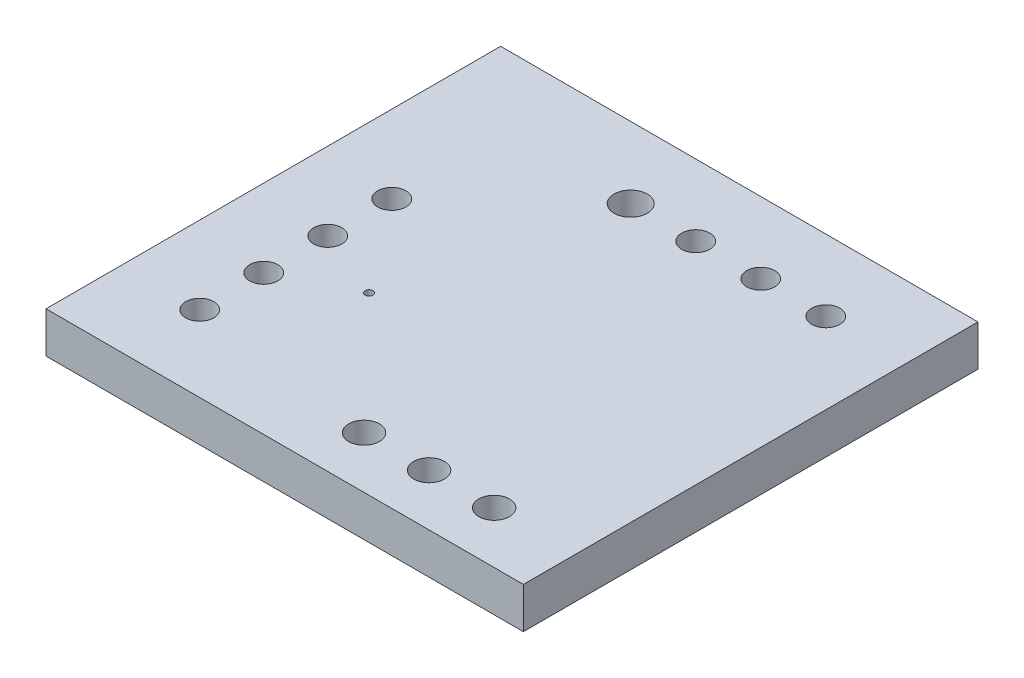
ISO-10303-21;
HEADER;
FILE_DESCRIPTION(('STEP AP214'),'2;1');
FILE_NAME('part.step','',(''),(''),'','','');
FILE_SCHEMA(('AUTOMOTIVE_DESIGN { 1 0 10303 214 1 1 1 1 }'));
ENDSEC;
DATA;
#1=APPLICATION_CONTEXT('core data for automotive mechanical design processes');
#2=APPLICATION_PROTOCOL_DEFINITION('international standard','automotive_design',2000,#1);
#3=PRODUCT_CONTEXT('',#1,'mechanical');
#4=PRODUCT('Part','Part','',(#3));
#5=PRODUCT_RELATED_PRODUCT_CATEGORY('part','',(#4));
#6=PRODUCT_DEFINITION_FORMATION('','',#4);
#7=PRODUCT_DEFINITION_CONTEXT('part definition',#1,'design');
#8=PRODUCT_DEFINITION('design','',#6,#7);
#9=PRODUCT_DEFINITION_SHAPE('','',#8);
#10=(LENGTH_UNIT() NAMED_UNIT(*) SI_UNIT(.MILLI.,.METRE.));
#11=(NAMED_UNIT(*) PLANE_ANGLE_UNIT() SI_UNIT($,.RADIAN.));
#12=(NAMED_UNIT(*) SI_UNIT($,.STERADIAN.) SOLID_ANGLE_UNIT());
#13=UNCERTAINTY_MEASURE_WITH_UNIT(LENGTH_MEASURE(1.E-05),#10,'distance_accuracy_value','');
#14=(GEOMETRIC_REPRESENTATION_CONTEXT(3) GLOBAL_UNCERTAINTY_ASSIGNED_CONTEXT((#13)) GLOBAL_UNIT_ASSIGNED_CONTEXT((#10,
#11,#12)) REPRESENTATION_CONTEXT('',''));
#15=CARTESIAN_POINT('',(0.,0.,0.));
#16=DIRECTION('',(0.,0.,1.));
#17=DIRECTION('',(1.,0.,0.));
#18=AXIS2_PLACEMENT_3D('',#15,#16,#17);
#19=CARTESIAN_POINT('',(-2.14630399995E-05,1.600050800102,3.073406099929E-05));
#20=DIRECTION('',(0.,-1.,0.));
#21=DIRECTION('',(0.,0.,-1.));
#22=AXIS2_PLACEMENT_3D('',#19,#20,#21);
#23=PLANE('',#22);
#24=CARTESIAN_POINT('',(6.159490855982,1.600050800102,6.858044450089));
#25=DIRECTION('',(0.,-1.,0.));
#26=DIRECTION('',(0.,0.,-1.));
#27=AXIS2_PLACEMENT_3D('',#24,#25,#26);
#28=CIRCLE('',#27,0.6);
#29=CARTESIAN_POINT('',(6.159490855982,1.600050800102,6.258044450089));
#30=VERTEX_POINT('',#29);
#31=EDGE_CURVE('E112',#30,#30,#28,.T.);
#32=ORIENTED_EDGE('',*,*,#31,.T.);
#33=EDGE_LOOP('',(#32));
#34=FACE_BOUND('',#33,.T.);
#35=CARTESIAN_POINT('',(3.619485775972,1.600050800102,6.858044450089));
#36=DIRECTION('',(0.,-1.,0.));
#37=DIRECTION('',(0.,0.,-1.));
#38=AXIS2_PLACEMENT_3D('',#35,#36,#37);
#39=CIRCLE('',#38,0.6);
#40=CARTESIAN_POINT('',(3.619485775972,1.600050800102,6.258044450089));
#41=VERTEX_POINT('',#40);
#42=EDGE_CURVE('E116',#41,#41,#39,.T.);
#43=ORIENTED_EDGE('',*,*,#42,.T.);
#44=EDGE_LOOP('',(#43));
#45=FACE_BOUND('',#44,.T.);
#46=CARTESIAN_POINT('',(1.079480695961,1.600050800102,6.858044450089));
#47=DIRECTION('',(0.,-1.,0.));
#48=DIRECTION('',(0.,0.,-1.));
#49=AXIS2_PLACEMENT_3D('',#46,#47,#48);
#50=CIRCLE('',#49,0.6);
#51=CARTESIAN_POINT('',(1.079480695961,1.600050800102,6.258044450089));
#52=VERTEX_POINT('',#51);
#53=EDGE_CURVE('E119',#52,#52,#50,.T.);
#54=ORIENTED_EDGE('',*,*,#53,.T.);
#55=EDGE_LOOP('',(#54));
#56=FACE_BOUND('',#55,.T.);
#57=CARTESIAN_POINT('',(-6.28653403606,1.600050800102,5.908971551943));
#58=DIRECTION('',(0.,-1.,0.));
#59=DIRECTION('',(0.,0.,-1.));
#60=AXIS2_PLACEMENT_3D('',#57,#58,#59);
#61=CIRCLE('',#60,0.550012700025);
#62=CARTESIAN_POINT('',(-6.28653403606,1.600050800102,5.358958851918));
#63=VERTEX_POINT('',#62);
#64=EDGE_CURVE('E122',#63,#63,#61,.T.);
#65=ORIENTED_EDGE('',*,*,#64,.T.);
#66=EDGE_LOOP('',(#65));
#67=FACE_BOUND('',#66,.T.);
#68=CARTESIAN_POINT('',(-6.28653403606,1.600050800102,3.408971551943));
#69=DIRECTION('',(0.,-1.,0.));
#70=DIRECTION('',(0.,0.,-1.));
#71=AXIS2_PLACEMENT_3D('',#68,#69,#70);
#72=CIRCLE('',#71,0.550012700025);
#73=CARTESIAN_POINT('',(-6.28653403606,1.600050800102,2.858958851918));
#74=VERTEX_POINT('',#73);
#75=EDGE_CURVE('E125',#74,#74,#72,.T.);
#76=ORIENTED_EDGE('',*,*,#75,.T.);
#77=EDGE_LOOP('',(#76));
#78=FACE_BOUND('',#77,.T.);
#79=CARTESIAN_POINT('',(-3.55247256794,1.600050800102,2.03203479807));
#80=DIRECTION('',(0.,-1.,0.));
#81=DIRECTION('',(0.,0.,-1.));
#82=AXIS2_PLACEMENT_3D('',#79,#80,#81);
#83=CIRCLE('',#82,0.152499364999);
#84=CARTESIAN_POINT('',(-3.55247256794,1.600050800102,1.879535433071));
#85=VERTEX_POINT('',#84);
#86=EDGE_CURVE('E128',#85,#85,#83,.T.);
#87=ORIENTED_EDGE('',*,*,#86,.T.);
#88=EDGE_LOOP('',(#87));
#89=FACE_BOUND('',#88,.T.);
#90=CARTESIAN_POINT('',(-6.28653403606,1.600050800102,0.908971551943));
#91=DIRECTION('',(0.,-1.,0.));
#92=DIRECTION('',(0.,0.,-1.));
#93=AXIS2_PLACEMENT_3D('',#90,#91,#92);
#94=CIRCLE('',#93,0.550012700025);
#95=CARTESIAN_POINT('',(-6.28653403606,1.600050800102,0.358958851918));
#96=VERTEX_POINT('',#95);
#97=EDGE_CURVE('E131',#96,#96,#94,.T.);
#98=ORIENTED_EDGE('',*,*,#97,.T.);
#99=EDGE_LOOP('',(#98));
#100=FACE_BOUND('',#99,.T.);
#101=CARTESIAN_POINT('',(-6.28653403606,1.600050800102,-1.591028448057));
#102=DIRECTION('',(0.,-1.,0.));
#103=DIRECTION('',(0.,0.,-1.));
#104=AXIS2_PLACEMENT_3D('',#101,#102,#103);
#105=CIRCLE('',#104,0.550012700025);
#106=CARTESIAN_POINT('',(-6.28653403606,1.600050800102,-2.141041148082));
#107=VERTEX_POINT('',#106);
#108=EDGE_CURVE('E134',#107,#107,#105,.T.);
#109=ORIENTED_EDGE('',*,*,#108,.T.);
#110=EDGE_LOOP('',(#109));
#111=FACE_BOUND('',#110,.T.);
#112=CARTESIAN_POINT('',(6.159490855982,1.600050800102,-6.095981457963));
#113=DIRECTION('',(0.,-1.,0.));
#114=DIRECTION('',(0.,0.,-1.));
#115=AXIS2_PLACEMENT_3D('',#112,#113,#114);
#116=CIRCLE('',#115,0.550012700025);
#117=CARTESIAN_POINT('',(6.159490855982,1.600050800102,-6.645994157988));
#118=VERTEX_POINT('',#117);
#119=EDGE_CURVE('E137',#118,#118,#116,.T.);
#120=ORIENTED_EDGE('',*,*,#119,.T.);
#121=EDGE_LOOP('',(#120));
#122=FACE_BOUND('',#121,.T.);
#123=CARTESIAN_POINT('',(1.079480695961,1.600050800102,-6.095981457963));
#124=DIRECTION('',(0.,-1.,0.));
#125=DIRECTION('',(0.,0.,-1.));
#126=AXIS2_PLACEMENT_3D('',#123,#124,#125);
#127=CIRCLE('',#126,0.550012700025);
#128=CARTESIAN_POINT('',(1.079480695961,1.600050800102,-6.645994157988));
#129=VERTEX_POINT('',#128);
#130=EDGE_CURVE('E140',#129,#129,#127,.T.);
#131=ORIENTED_EDGE('',*,*,#130,.T.);
#132=EDGE_LOOP('',(#131));
#133=FACE_BOUND('',#132,.T.);
#134=CARTESIAN_POINT('',(3.619485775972,1.600050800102,-6.095981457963));
#135=DIRECTION('',(0.,-1.,0.));
#136=DIRECTION('',(0.,0.,-1.));
#137=AXIS2_PLACEMENT_3D('',#134,#135,#136);
#138=CIRCLE('',#137,0.550012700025);
#139=CARTESIAN_POINT('',(3.619485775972,1.600050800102,-6.645994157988));
#140=VERTEX_POINT('',#139);
#141=EDGE_CURVE('E142',#140,#140,#138,.T.);
#142=ORIENTED_EDGE('',*,*,#141,.T.);
#143=EDGE_LOOP('',(#142));
#144=FACE_BOUND('',#143,.T.);
#145=CARTESIAN_POINT('',(-1.46052438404,1.600050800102,-6.095981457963));
#146=DIRECTION('',(0.,-1.,0.));
#147=DIRECTION('',(0.,0.,-1.));
#148=AXIS2_PLACEMENT_3D('',#145,#146,#147);
#149=CIRCLE('',#148,0.650012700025);
#150=CARTESIAN_POINT('',(-1.46052438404,1.600050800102,-6.745994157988));
#151=VERTEX_POINT('',#150);
#152=EDGE_CURVE('E18',#151,#151,#149,.T.);
#153=ORIENTED_EDGE('',*,*,#152,.T.);
#154=EDGE_LOOP('',(#153));
#155=FACE_BOUND('',#154,.T.);
#156=DIRECTION('',(0.,0.,1.));
#157=VECTOR('',#156,1.);
#158=CARTESIAN_POINT('',(-9.32184010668,1.600050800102,8.877348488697));
#159=LINE('',#158,#157);
#160=CARTESIAN_POINT('',(-9.32184010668,1.600050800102,8.877348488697));
#161=VERTEX_POINT('',#160);
#162=CARTESIAN_POINT('',(-9.32184010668,1.600050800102,-8.877287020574));
#163=VERTEX_POINT('',#162);
#164=EDGE_CURVE('E68',#161,#163,#159,.F.);
#165=ORIENTED_EDGE('',*,*,#164,.F.);
#166=DIRECTION('',(1.,0.,0.));
#167=VECTOR('',#166,1.);
#168=CARTESIAN_POINT('',(9.321797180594,1.600050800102,8.877348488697));
#169=LINE('',#168,#167);
#170=CARTESIAN_POINT('',(9.321797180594,1.600050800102,8.877348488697));
#171=VERTEX_POINT('',#170);
#172=EDGE_CURVE('E53',#171,#161,#169,.F.);
#173=ORIENTED_EDGE('',*,*,#172,.F.);
#174=DIRECTION('',(0.,0.,-1.));
#175=VECTOR('',#174,1.);
#176=CARTESIAN_POINT('',(9.321797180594,1.600050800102,-8.877287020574));
#177=LINE('',#176,#175);
#178=CARTESIAN_POINT('',(9.321797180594,1.600050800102,-8.877287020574));
#179=VERTEX_POINT('',#178);
#180=EDGE_CURVE('E58',#179,#171,#177,.F.);
#181=ORIENTED_EDGE('',*,*,#180,.F.);
#182=DIRECTION('',(-1.,0.,0.));
#183=VECTOR('',#182,1.);
#184=CARTESIAN_POINT('',(-9.32184010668,1.600050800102,-8.877287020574));
#185=LINE('',#184,#183);
#186=EDGE_CURVE('E149',#163,#179,#185,.F.);
#187=ORIENTED_EDGE('',*,*,#186,.F.);
#188=EDGE_LOOP('',(#165,#173,#181,#187));
#189=FACE_BOUND('',#188,.T.);
#190=ADVANCED_FACE('F15',(#34,#45,#56,#67,#78,#89,#100,#111,#122,#133,#144,#155,#189),#23,.F.);
#191=CARTESIAN_POINT('',(9.321797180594,0.,-8.877287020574));
#192=DIRECTION('',(1.,0.,0.));
#193=DIRECTION('',(0.,0.,-1.));
#194=AXIS2_PLACEMENT_3D('',#191,#192,#193);
#195=PLANE('',#194);
#196=DIRECTION('',(0.,1.,0.));
#197=VECTOR('',#196,1.);
#198=CARTESIAN_POINT('',(9.321797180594,0.,8.877348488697));
#199=LINE('',#198,#197);
#200=CARTESIAN_POINT('',(9.321797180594,0.,8.877348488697));
#201=VERTEX_POINT('',#200);
#202=EDGE_CURVE('E60',#201,#171,#199,.T.);
#203=ORIENTED_EDGE('',*,*,#202,.F.);
#204=DIRECTION('',(0.,0.,-1.));
#205=VECTOR('',#204,1.);
#206=CARTESIAN_POINT('',(9.321797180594,0.,3.073406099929E-05));
#207=LINE('',#206,#205);
#208=CARTESIAN_POINT('',(9.321797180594,0.,-8.877287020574));
#209=VERTEX_POINT('',#208);
#210=EDGE_CURVE('E115',#209,#201,#207,.F.);
#211=ORIENTED_EDGE('',*,*,#210,.F.);
#212=DIRECTION('',(0.,1.,0.));
#213=VECTOR('',#212,1.);
#214=CARTESIAN_POINT('',(9.321797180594,0.,-8.877287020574));
#215=LINE('',#214,#213);
#216=EDGE_CURVE('E63',#179,#209,#215,.F.);
#217=ORIENTED_EDGE('',*,*,#216,.F.);
#218=ORIENTED_EDGE('',*,*,#180,.T.);
#219=EDGE_LOOP('',(#203,#211,#217,#218));
#220=FACE_BOUND('',#219,.T.);
#221=ADVANCED_FACE('F59',(#220),#195,.T.);
#222=CARTESIAN_POINT('',(9.321797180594,0.,8.877348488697));
#223=DIRECTION('',(0.,0.,1.));
#224=DIRECTION('',(1.,0.,0.));
#225=AXIS2_PLACEMENT_3D('',#222,#223,#224);
#226=PLANE('',#225);
#227=DIRECTION('',(0.,1.,0.));
#228=VECTOR('',#227,1.);
#229=CARTESIAN_POINT('',(-9.32184010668,0.,8.877348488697));
#230=LINE('',#229,#228);
#231=CARTESIAN_POINT('',(-9.32184010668,0.,8.877348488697));
#232=VERTEX_POINT('',#231);
#233=EDGE_CURVE('E70',#232,#161,#230,.T.);
#234=ORIENTED_EDGE('',*,*,#233,.F.);
#235=DIRECTION('',(1.,0.,0.));
#236=VECTOR('',#235,1.);
#237=CARTESIAN_POINT('',(-2.14630399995E-05,0.,8.877348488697));
#238=LINE('',#237,#236);
#239=EDGE_CURVE('E74',#201,#232,#238,.F.);
#240=ORIENTED_EDGE('',*,*,#239,.F.);
#241=ORIENTED_EDGE('',*,*,#202,.T.);
#242=ORIENTED_EDGE('',*,*,#172,.T.);
#243=EDGE_LOOP('',(#234,#240,#241,#242));
#244=FACE_BOUND('',#243,.T.);
#245=ADVANCED_FACE('F72',(#244),#226,.T.);
#246=CARTESIAN_POINT('',(-9.32184010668,0.,8.877348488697));
#247=DIRECTION('',(-1.,0.,0.));
#248=DIRECTION('',(0.,0.,1.));
#249=AXIS2_PLACEMENT_3D('',#246,#247,#248);
#250=PLANE('',#249);
#251=DIRECTION('',(0.,1.,0.));
#252=VECTOR('',#251,1.);
#253=CARTESIAN_POINT('',(-9.32184010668,0.,-8.877287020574));
#254=LINE('',#253,#252);
#255=CARTESIAN_POINT('',(-9.32184010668,0.,-8.877287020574));
#256=VERTEX_POINT('',#255);
#257=EDGE_CURVE('E33',#256,#163,#254,.T.);
#258=ORIENTED_EDGE('',*,*,#257,.F.);
#259=DIRECTION('',(0.,0.,-1.));
#260=VECTOR('',#259,1.);
#261=CARTESIAN_POINT('',(-9.32184010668,0.,3.073406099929E-05));
#262=LINE('',#261,#260);
#263=EDGE_CURVE('E160',#232,#256,#262,.T.);
#264=ORIENTED_EDGE('',*,*,#263,.F.);
#265=ORIENTED_EDGE('',*,*,#233,.T.);
#266=ORIENTED_EDGE('',*,*,#164,.T.);
#267=EDGE_LOOP('',(#258,#264,#265,#266));
#268=FACE_BOUND('',#267,.T.);
#269=ADVANCED_FACE('F158',(#268),#250,.T.);
#270=CARTESIAN_POINT('',(-9.32184010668,0.,-8.877287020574));
#271=DIRECTION('',(0.,0.,-1.));
#272=DIRECTION('',(-1.,0.,0.));
#273=AXIS2_PLACEMENT_3D('',#270,#271,#272);
#274=PLANE('',#273);
#275=ORIENTED_EDGE('',*,*,#216,.T.);
#276=DIRECTION('',(1.,0.,0.));
#277=VECTOR('',#276,1.);
#278=CARTESIAN_POINT('',(-2.14630399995E-05,0.,-8.877287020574));
#279=LINE('',#278,#277);
#280=EDGE_CURVE('E111',#256,#209,#279,.T.);
#281=ORIENTED_EDGE('',*,*,#280,.F.);
#282=ORIENTED_EDGE('',*,*,#257,.T.);
#283=ORIENTED_EDGE('',*,*,#186,.T.);
#284=EDGE_LOOP('',(#275,#281,#282,#283));
#285=FACE_BOUND('',#284,.T.);
#286=ADVANCED_FACE('F165',(#285),#274,.T.);
#287=CARTESIAN_POINT('',(-1.46052438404,0.,-6.095981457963));
#288=DIRECTION('',(0.,-1.,0.));
#289=DIRECTION('',(0.,0.,-1.));
#290=AXIS2_PLACEMENT_3D('',#287,#288,#289);
#291=CYLINDRICAL_SURFACE('',#290,0.650012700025);
#292=ORIENTED_EDGE('',*,*,#152,.F.);
#293=EDGE_LOOP('',(#292));
#294=FACE_BOUND('',#293,.T.);
#295=CARTESIAN_POINT('',(-1.46052438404,0.,-6.095981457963));
#296=DIRECTION('',(0.,-1.,0.));
#297=DIRECTION('',(0.,0.,-1.));
#298=AXIS2_PLACEMENT_3D('',#295,#296,#297);
#299=CIRCLE('',#298,0.650012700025);
#300=CARTESIAN_POINT('',(-1.46052438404,0.,-6.745994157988));
#301=VERTEX_POINT('',#300);
#302=EDGE_CURVE('E108',#301,#301,#299,.F.);
#303=ORIENTED_EDGE('',*,*,#302,.F.);
#304=EDGE_LOOP('',(#303));
#305=FACE_BOUND('',#304,.T.);
#306=ADVANCED_FACE('F167',(#294,#305),#291,.F.);
#307=CARTESIAN_POINT('',(3.619485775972,0.,-6.095981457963));
#308=DIRECTION('',(0.,-1.,0.));
#309=DIRECTION('',(0.,0.,-1.));
#310=AXIS2_PLACEMENT_3D('',#307,#308,#309);
#311=CYLINDRICAL_SURFACE('',#310,0.550012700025);
#312=ORIENTED_EDGE('',*,*,#141,.F.);
#313=EDGE_LOOP('',(#312));
#314=FACE_BOUND('',#313,.T.);
#315=CARTESIAN_POINT('',(3.619485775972,0.,-6.095981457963));
#316=DIRECTION('',(0.,-1.,0.));
#317=DIRECTION('',(0.,0.,-1.));
#318=AXIS2_PLACEMENT_3D('',#315,#316,#317);
#319=CIRCLE('',#318,0.550012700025);
#320=CARTESIAN_POINT('',(3.619485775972,0.,-6.645994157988));
#321=VERTEX_POINT('',#320);
#322=EDGE_CURVE('E105',#321,#321,#319,.F.);
#323=ORIENTED_EDGE('',*,*,#322,.F.);
#324=EDGE_LOOP('',(#323));
#325=FACE_BOUND('',#324,.T.);
#326=ADVANCED_FACE('F174',(#314,#325),#311,.F.);
#327=CARTESIAN_POINT('',(1.079480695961,0.,-6.095981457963));
#328=DIRECTION('',(0.,-1.,0.));
#329=DIRECTION('',(0.,0.,-1.));
#330=AXIS2_PLACEMENT_3D('',#327,#328,#329);
#331=CYLINDRICAL_SURFACE('',#330,0.550012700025);
#332=ORIENTED_EDGE('',*,*,#130,.F.);
#333=EDGE_LOOP('',(#332));
#334=FACE_BOUND('',#333,.T.);
#335=CARTESIAN_POINT('',(1.079480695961,0.,-6.095981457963));
#336=DIRECTION('',(0.,-1.,0.));
#337=DIRECTION('',(0.,0.,-1.));
#338=AXIS2_PLACEMENT_3D('',#335,#336,#337);
#339=CIRCLE('',#338,0.550012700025);
#340=CARTESIAN_POINT('',(1.079480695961,0.,-6.645994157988));
#341=VERTEX_POINT('',#340);
#342=EDGE_CURVE('E102',#341,#341,#339,.F.);
#343=ORIENTED_EDGE('',*,*,#342,.F.);
#344=EDGE_LOOP('',(#343));
#345=FACE_BOUND('',#344,.T.);
#346=ADVANCED_FACE('F220',(#334,#345),#331,.F.);
#347=CARTESIAN_POINT('',(6.159490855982,0.,-6.095981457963));
#348=DIRECTION('',(0.,-1.,0.));
#349=DIRECTION('',(0.,0.,-1.));
#350=AXIS2_PLACEMENT_3D('',#347,#348,#349);
#351=CYLINDRICAL_SURFACE('',#350,0.550012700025);
#352=ORIENTED_EDGE('',*,*,#119,.F.);
#353=EDGE_LOOP('',(#352));
#354=FACE_BOUND('',#353,.T.);
#355=CARTESIAN_POINT('',(6.159490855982,0.,-6.095981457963));
#356=DIRECTION('',(0.,-1.,0.));
#357=DIRECTION('',(0.,0.,-1.));
#358=AXIS2_PLACEMENT_3D('',#355,#356,#357);
#359=CIRCLE('',#358,0.550012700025);
#360=CARTESIAN_POINT('',(6.159490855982,0.,-6.645994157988));
#361=VERTEX_POINT('',#360);
#362=EDGE_CURVE('E99',#361,#361,#359,.F.);
#363=ORIENTED_EDGE('',*,*,#362,.F.);
#364=EDGE_LOOP('',(#363));
#365=FACE_BOUND('',#364,.T.);
#366=ADVANCED_FACE('F216',(#354,#365),#351,.F.);
#367=CARTESIAN_POINT('',(-6.28653403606,0.,-1.591028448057));
#368=DIRECTION('',(0.,-1.,0.));
#369=DIRECTION('',(0.,0.,-1.));
#370=AXIS2_PLACEMENT_3D('',#367,#368,#369);
#371=CYLINDRICAL_SURFACE('',#370,0.550012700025);
#372=ORIENTED_EDGE('',*,*,#108,.F.);
#373=EDGE_LOOP('',(#372));
#374=FACE_BOUND('',#373,.T.);
#375=CARTESIAN_POINT('',(-6.28653403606,0.,-1.591028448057));
#376=DIRECTION('',(0.,-1.,0.));
#377=DIRECTION('',(0.,0.,-1.));
#378=AXIS2_PLACEMENT_3D('',#375,#376,#377);
#379=CIRCLE('',#378,0.550012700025);
#380=CARTESIAN_POINT('',(-6.28653403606,0.,-2.141041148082));
#381=VERTEX_POINT('',#380);
#382=EDGE_CURVE('E96',#381,#381,#379,.F.);
#383=ORIENTED_EDGE('',*,*,#382,.F.);
#384=EDGE_LOOP('',(#383));
#385=FACE_BOUND('',#384,.T.);
#386=ADVANCED_FACE('F212',(#374,#385),#371,.F.);
#387=CARTESIAN_POINT('',(-6.28653403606,0.,0.908971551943));
#388=DIRECTION('',(0.,-1.,0.));
#389=DIRECTION('',(0.,0.,-1.));
#390=AXIS2_PLACEMENT_3D('',#387,#388,#389);
#391=CYLINDRICAL_SURFACE('',#390,0.550012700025);
#392=ORIENTED_EDGE('',*,*,#97,.F.);
#393=EDGE_LOOP('',(#392));
#394=FACE_BOUND('',#393,.T.);
#395=CARTESIAN_POINT('',(-6.28653403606,0.,0.908971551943));
#396=DIRECTION('',(0.,-1.,0.));
#397=DIRECTION('',(0.,0.,-1.));
#398=AXIS2_PLACEMENT_3D('',#395,#396,#397);
#399=CIRCLE('',#398,0.550012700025);
#400=CARTESIAN_POINT('',(-6.28653403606,0.,0.358958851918));
#401=VERTEX_POINT('',#400);
#402=EDGE_CURVE('E93',#401,#401,#399,.F.);
#403=ORIENTED_EDGE('',*,*,#402,.F.);
#404=EDGE_LOOP('',(#403));
#405=FACE_BOUND('',#404,.T.);
#406=ADVANCED_FACE('F208',(#394,#405),#391,.F.);
#407=CARTESIAN_POINT('',(-3.55247256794,0.,2.03203479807));
#408=DIRECTION('',(0.,-1.,0.));
#409=DIRECTION('',(0.,0.,-1.));
#410=AXIS2_PLACEMENT_3D('',#407,#408,#409);
#411=CYLINDRICAL_SURFACE('',#410,0.152499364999);
#412=ORIENTED_EDGE('',*,*,#86,.F.);
#413=EDGE_LOOP('',(#412));
#414=FACE_BOUND('',#413,.T.);
#415=CARTESIAN_POINT('',(-3.55247256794,0.,2.03203479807));
#416=DIRECTION('',(0.,-1.,0.));
#417=DIRECTION('',(0.,0.,-1.));
#418=AXIS2_PLACEMENT_3D('',#415,#416,#417);
#419=CIRCLE('',#418,0.152499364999);
#420=CARTESIAN_POINT('',(-3.55247256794,0.,1.879535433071));
#421=VERTEX_POINT('',#420);
#422=EDGE_CURVE('E90',#421,#421,#419,.F.);
#423=ORIENTED_EDGE('',*,*,#422,.F.);
#424=EDGE_LOOP('',(#423));
#425=FACE_BOUND('',#424,.T.);
#426=ADVANCED_FACE('F204',(#414,#425),#411,.F.);
#427=CARTESIAN_POINT('',(-6.28653403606,0.,3.408971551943));
#428=DIRECTION('',(0.,-1.,0.));
#429=DIRECTION('',(0.,0.,-1.));
#430=AXIS2_PLACEMENT_3D('',#427,#428,#429);
#431=CYLINDRICAL_SURFACE('',#430,0.550012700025);
#432=ORIENTED_EDGE('',*,*,#75,.F.);
#433=EDGE_LOOP('',(#432));
#434=FACE_BOUND('',#433,.T.);
#435=CARTESIAN_POINT('',(-6.28653403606,0.,3.408971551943));
#436=DIRECTION('',(0.,-1.,0.));
#437=DIRECTION('',(0.,0.,-1.));
#438=AXIS2_PLACEMENT_3D('',#435,#436,#437);
#439=CIRCLE('',#438,0.550012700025);
#440=CARTESIAN_POINT('',(-6.28653403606,0.,2.858958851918));
#441=VERTEX_POINT('',#440);
#442=EDGE_CURVE('E87',#441,#441,#439,.F.);
#443=ORIENTED_EDGE('',*,*,#442,.F.);
#444=EDGE_LOOP('',(#443));
#445=FACE_BOUND('',#444,.T.);
#446=ADVANCED_FACE('F200',(#434,#445),#431,.F.);
#447=CARTESIAN_POINT('',(-6.28653403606,0.,5.908971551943));
#448=DIRECTION('',(0.,-1.,0.));
#449=DIRECTION('',(0.,0.,-1.));
#450=AXIS2_PLACEMENT_3D('',#447,#448,#449);
#451=CYLINDRICAL_SURFACE('',#450,0.550012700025);
#452=ORIENTED_EDGE('',*,*,#64,.F.);
#453=EDGE_LOOP('',(#452));
#454=FACE_BOUND('',#453,.T.);
#455=CARTESIAN_POINT('',(-6.28653403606,0.,5.908971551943));
#456=DIRECTION('',(0.,-1.,0.));
#457=DIRECTION('',(0.,0.,-1.));
#458=AXIS2_PLACEMENT_3D('',#455,#456,#457);
#459=CIRCLE('',#458,0.550012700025);
#460=CARTESIAN_POINT('',(-6.28653403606,0.,5.358958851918));
#461=VERTEX_POINT('',#460);
#462=EDGE_CURVE('E84',#461,#461,#459,.F.);
#463=ORIENTED_EDGE('',*,*,#462,.F.);
#464=EDGE_LOOP('',(#463));
#465=FACE_BOUND('',#464,.T.);
#466=ADVANCED_FACE('F196',(#454,#465),#451,.F.);
#467=CARTESIAN_POINT('',(1.079480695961,0.,6.858044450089));
#468=DIRECTION('',(0.,-1.,0.));
#469=DIRECTION('',(0.,0.,-1.));
#470=AXIS2_PLACEMENT_3D('',#467,#468,#469);
#471=CYLINDRICAL_SURFACE('',#470,0.6);
#472=ORIENTED_EDGE('',*,*,#53,.F.);
#473=EDGE_LOOP('',(#472));
#474=FACE_BOUND('',#473,.T.);
#475=CARTESIAN_POINT('',(1.079480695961,0.,6.858044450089));
#476=DIRECTION('',(0.,-1.,0.));
#477=DIRECTION('',(0.,0.,-1.));
#478=AXIS2_PLACEMENT_3D('',#475,#476,#477);
#479=CIRCLE('',#478,0.6);
#480=CARTESIAN_POINT('',(1.079480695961,0.,6.258044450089));
#481=VERTEX_POINT('',#480);
#482=EDGE_CURVE('E81',#481,#481,#479,.F.);
#483=ORIENTED_EDGE('',*,*,#482,.F.);
#484=EDGE_LOOP('',(#483));
#485=FACE_BOUND('',#484,.T.);
#486=ADVANCED_FACE('F192',(#474,#485),#471,.F.);
#487=CARTESIAN_POINT('',(3.619485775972,0.,6.858044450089));
#488=DIRECTION('',(0.,-1.,0.));
#489=DIRECTION('',(0.,0.,-1.));
#490=AXIS2_PLACEMENT_3D('',#487,#488,#489);
#491=CYLINDRICAL_SURFACE('',#490,0.6);
#492=ORIENTED_EDGE('',*,*,#42,.F.);
#493=EDGE_LOOP('',(#492));
#494=FACE_BOUND('',#493,.T.);
#495=CARTESIAN_POINT('',(3.619485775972,0.,6.858044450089));
#496=DIRECTION('',(0.,-1.,0.));
#497=DIRECTION('',(0.,0.,-1.));
#498=AXIS2_PLACEMENT_3D('',#495,#496,#497);
#499=CIRCLE('',#498,0.6);
#500=CARTESIAN_POINT('',(3.619485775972,0.,6.258044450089));
#501=VERTEX_POINT('',#500);
#502=EDGE_CURVE('E24',#501,#501,#499,.F.);
#503=ORIENTED_EDGE('',*,*,#502,.F.);
#504=EDGE_LOOP('',(#503));
#505=FACE_BOUND('',#504,.T.);
#506=ADVANCED_FACE('F185',(#494,#505),#491,.F.);
#507=CARTESIAN_POINT('',(6.159490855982,0.,6.858044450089));
#508=DIRECTION('',(0.,-1.,0.));
#509=DIRECTION('',(0.,0.,-1.));
#510=AXIS2_PLACEMENT_3D('',#507,#508,#509);
#511=CYLINDRICAL_SURFACE('',#510,0.6);
#512=ORIENTED_EDGE('',*,*,#31,.F.);
#513=EDGE_LOOP('',(#512));
#514=FACE_BOUND('',#513,.T.);
#515=CARTESIAN_POINT('',(6.159490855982,0.,6.858044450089));
#516=DIRECTION('',(0.,-1.,0.));
#517=DIRECTION('',(0.,0.,-1.));
#518=AXIS2_PLACEMENT_3D('',#515,#516,#517);
#519=CIRCLE('',#518,0.6);
#520=CARTESIAN_POINT('',(6.159490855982,0.,6.258044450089));
#521=VERTEX_POINT('',#520);
#522=EDGE_CURVE('E10',#521,#521,#519,.F.);
#523=ORIENTED_EDGE('',*,*,#522,.F.);
#524=EDGE_LOOP('',(#523));
#525=FACE_BOUND('',#524,.T.);
#526=ADVANCED_FACE('F179',(#514,#525),#511,.F.);
#527=CARTESIAN_POINT('',(-2.14630399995E-05,0.,3.073406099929E-05));
#528=DIRECTION('',(0.,-1.,0.));
#529=DIRECTION('',(0.,0.,-1.));
#530=AXIS2_PLACEMENT_3D('',#527,#528,#529);
#531=PLANE('',#530);
#532=ORIENTED_EDGE('',*,*,#522,.T.);
#533=EDGE_LOOP('',(#532));
#534=FACE_BOUND('',#533,.T.);
#535=ORIENTED_EDGE('',*,*,#502,.T.);
#536=EDGE_LOOP('',(#535));
#537=FACE_BOUND('',#536,.T.);
#538=ORIENTED_EDGE('',*,*,#482,.T.);
#539=EDGE_LOOP('',(#538));
#540=FACE_BOUND('',#539,.T.);
#541=ORIENTED_EDGE('',*,*,#462,.T.);
#542=EDGE_LOOP('',(#541));
#543=FACE_BOUND('',#542,.T.);
#544=ORIENTED_EDGE('',*,*,#442,.T.);
#545=EDGE_LOOP('',(#544));
#546=FACE_BOUND('',#545,.T.);
#547=ORIENTED_EDGE('',*,*,#422,.T.);
#548=EDGE_LOOP('',(#547));
#549=FACE_BOUND('',#548,.T.);
#550=ORIENTED_EDGE('',*,*,#402,.T.);
#551=EDGE_LOOP('',(#550));
#552=FACE_BOUND('',#551,.T.);
#553=ORIENTED_EDGE('',*,*,#382,.T.);
#554=EDGE_LOOP('',(#553));
#555=FACE_BOUND('',#554,.T.);
#556=ORIENTED_EDGE('',*,*,#362,.T.);
#557=EDGE_LOOP('',(#556));
#558=FACE_BOUND('',#557,.T.);
#559=ORIENTED_EDGE('',*,*,#342,.T.);
#560=EDGE_LOOP('',(#559));
#561=FACE_BOUND('',#560,.T.);
#562=ORIENTED_EDGE('',*,*,#322,.T.);
#563=EDGE_LOOP('',(#562));
#564=FACE_BOUND('',#563,.T.);
#565=ORIENTED_EDGE('',*,*,#302,.T.);
#566=EDGE_LOOP('',(#565));
#567=FACE_BOUND('',#566,.T.);
#568=ORIENTED_EDGE('',*,*,#263,.T.);
#569=ORIENTED_EDGE('',*,*,#280,.T.);
#570=ORIENTED_EDGE('',*,*,#210,.T.);
#571=ORIENTED_EDGE('',*,*,#239,.T.);
#572=EDGE_LOOP('',(#568,#569,#570,#571));
#573=FACE_BOUND('',#572,.T.);
#574=ADVANCED_FACE('F163',(#534,#537,#540,#543,#546,#549,#552,#555,#558,#561,#564,#567,#573),
#531,.T.);
#575=CLOSED_SHELL('',(#190,#221,#245,#269,#286,#306,#326,#346,#366,#386,#406,#426,#446,#466,
#486,#506,#526,#574));
#576=MANIFOLD_SOLID_BREP('B1',#575);
#577=ADVANCED_BREP_SHAPE_REPRESENTATION('',(#18,#576),#14);
#578=SHAPE_DEFINITION_REPRESENTATION(#9,#577);
ENDSEC;
END-ISO-10303-21;
